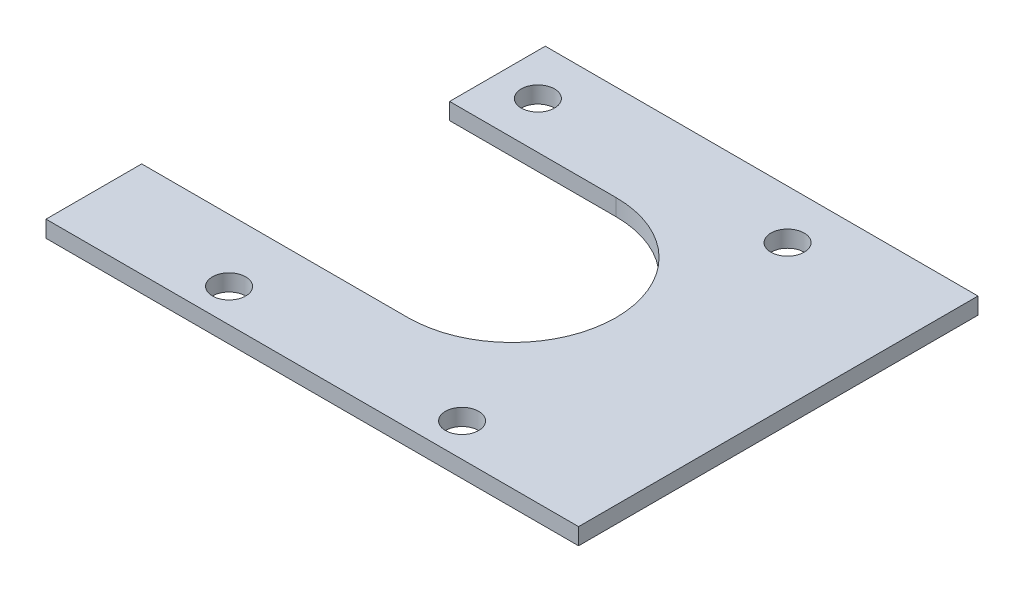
from build123d import *

# Parameters (mm, degrees)
BOSS_EXTRUDE1_DEPTH = 1.5875
SKETCH5_R           = 1.5875
CUT_EXTRUDE2_DEPTH  = 57.818308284
SKETCH6_W           = 75.81445216
SKETCH6_H           = 40.479502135
CUT_EXTRUDE3_DEPTH  = 57.818308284


with BuildPart() as part:
    # Sketch1 → Boss-Extrude1 (new body)
    with BuildSketch(Plane(origin=(0, 0, 0), x_dir=(1, 0, 0), z_dir=(0, 1, 0))):
        with BuildLine():
            Line((25.4, 19.05), (-15.875, 19.05))
            Line((-15.875, 19.05), (-15.875, 9.921875))
            Line((-15.875, 9.921875), (0, 9.921875))
            ThreePointArc((0, 9.921875), (7.015825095, 7.015825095), (9.921875, 0))
            ThreePointArc((9.921875, 0), (7.015825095, -7.015825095), (0, -9.921875))
            Line((0, -9.921875), (-25.4, -9.921875))
            Line((-25.4, -9.921875), (-25.4, -50.8))
            Line((-25.4, -50.8), (25.4, -50.8))
            Line((25.4, -50.8), (25.4, 19.05))
        make_face()
    extrude(amount=BOSS_EXTRUDE1_DEPTH)

    # Sketch5 → Cut-Extrude2 (cut, through all)
    with BuildSketch(Plane(origin=(0, 1.5875, 0), x_dir=(1, 0, 0), z_dir=(0, 1, 0))):
        with Locations(Location((11.90625, 14.3764, 0), (0, 0, 270))):
            Circle(SKETCH5_R)
        with Locations(Location((-11.90625, 14.3764, 0), (0, 0, 270))):
            Circle(SKETCH5_R)
        with Locations(Location((11.1125, -15.875, 0), (0, 0, 270))):
            Circle(SKETCH5_R)
        with Locations(Location((-11.1125, -15.875, 0), (0, 0, 270))):
            Circle(SKETCH5_R)
    extrude(amount=-CUT_EXTRUDE2_DEPTH, mode=Mode.SUBTRACT)

    # Sketch6 → Cut-Extrude3 (cut, through all)
    with BuildSketch(Plane(origin=(0, 1.5875, 0), x_dir=(1, 0, 0), z_dir=(0, 1, 0))):
        with Locations((-6.201831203, -39.289751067)):
            Rectangle(SKETCH6_W, SKETCH6_H)
    extrude(amount=-CUT_EXTRUDE3_DEPTH, mode=Mode.SUBTRACT)


solid = part.part
